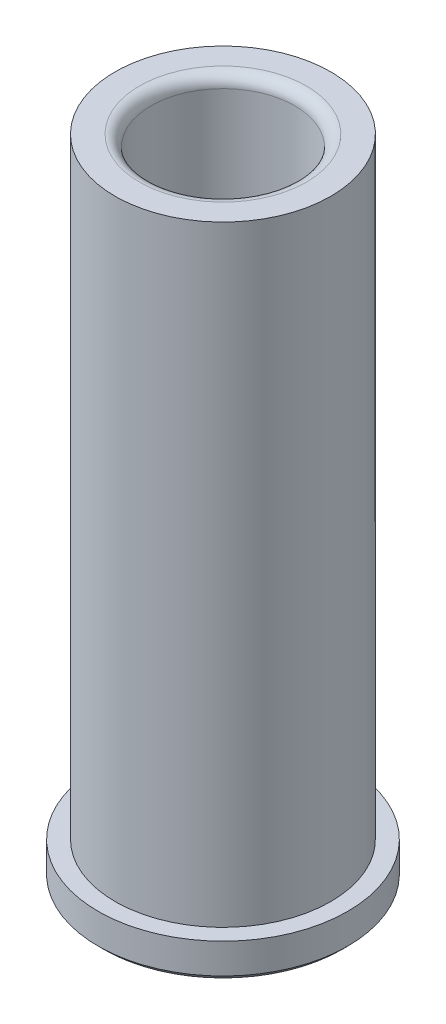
ISO-10303-21;
HEADER;
FILE_DESCRIPTION(('STEP AP214'),'2;1');
FILE_NAME('part.step','',(''),(''),'','','');
FILE_SCHEMA(('AUTOMOTIVE_DESIGN { 1 0 10303 214 1 1 1 1 }'));
ENDSEC;
DATA;
#1=APPLICATION_CONTEXT('core data for automotive mechanical design processes');
#2=APPLICATION_PROTOCOL_DEFINITION('international standard','automotive_design',2000,#1);
#3=PRODUCT_CONTEXT('',#1,'mechanical');
#4=PRODUCT('Part','Part','',(#3));
#5=PRODUCT_RELATED_PRODUCT_CATEGORY('part','',(#4));
#6=PRODUCT_DEFINITION_FORMATION('','',#4);
#7=PRODUCT_DEFINITION_CONTEXT('part definition',#1,'design');
#8=PRODUCT_DEFINITION('design','',#6,#7);
#9=PRODUCT_DEFINITION_SHAPE('','',#8);
#10=(LENGTH_UNIT() NAMED_UNIT(*) SI_UNIT(.MILLI.,.METRE.));
#11=(NAMED_UNIT(*) PLANE_ANGLE_UNIT() SI_UNIT($,.RADIAN.));
#12=(NAMED_UNIT(*) SI_UNIT($,.STERADIAN.) SOLID_ANGLE_UNIT());
#13=UNCERTAINTY_MEASURE_WITH_UNIT(LENGTH_MEASURE(1.E-05),#10,'distance_accuracy_value','');
#14=(GEOMETRIC_REPRESENTATION_CONTEXT(3) GLOBAL_UNCERTAINTY_ASSIGNED_CONTEXT((#13)) GLOBAL_UNIT_ASSIGNED_CONTEXT((#10,
#11,#12)) REPRESENTATION_CONTEXT('',''));
#15=CARTESIAN_POINT('',(0.,0.,0.));
#16=DIRECTION('',(0.,0.,1.));
#17=DIRECTION('',(1.,0.,0.));
#18=AXIS2_PLACEMENT_3D('',#15,#16,#17);
#19=CARTESIAN_POINT('',(3.49148336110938E-12,-1000.,0.));
#20=DIRECTION('',(0.,-1.,0.));
#21=DIRECTION('',(1.,0.,0.));
#22=AXIS2_PLACEMENT_3D('',#19,#20,#21);
#23=CYLINDRICAL_SURFACE('',#22,14.2938499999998);
#24=CARTESIAN_POINT('',(0.,4.7625,0.));
#25=DIRECTION('',(0.,-1.,0.));
#26=DIRECTION('',(1.,0.,0.));
#27=AXIS2_PLACEMENT_3D('',#24,#25,#26);
#28=CIRCLE('',#27,14.29385);
#29=CARTESIAN_POINT('',(14.29385,4.76250000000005,0.));
#30=VERTEX_POINT('',#29);
#31=EDGE_CURVE('E60',#30,#30,#28,.T.);
#32=ORIENTED_EDGE('',*,*,#31,.F.);
#33=EDGE_LOOP('',(#32));
#34=FACE_BOUND('',#33,.T.);
#35=CARTESIAN_POINT('',(-2.99307411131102E-13,85.7250000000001,0.));
#36=DIRECTION('',(0.,-1.,0.));
#37=DIRECTION('',(1.,0.,0.));
#38=AXIS2_PLACEMENT_3D('',#35,#36,#37);
#39=CIRCLE('',#38,14.2938499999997);
#40=CARTESIAN_POINT('',(14.2938499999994,85.7250000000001,0.));
#41=VERTEX_POINT('',#40);
#42=EDGE_CURVE('E39',#41,#41,#39,.T.);
#43=ORIENTED_EDGE('',*,*,#42,.T.);
#44=EDGE_LOOP('',(#43));
#45=FACE_BOUND('',#44,.T.);
#46=ADVANCED_FACE('F28',(#34,#45),#23,.T.);
#47=CARTESIAN_POINT('',(-14.29385,85.725,0.));
#48=DIRECTION('',(0.,-1.,0.));
#49=DIRECTION('',(1.,0.,0.));
#50=AXIS2_PLACEMENT_3D('',#47,#48,#49);
#51=PLANE('',#50);
#52=CARTESIAN_POINT('',(-2.99307411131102E-13,85.725,0.));
#53=DIRECTION('',(0.,-1.,0.));
#54=DIRECTION('',(1.,0.,0.));
#55=AXIS2_PLACEMENT_3D('',#52,#53,#54);
#56=CIRCLE('',#55,11.0553499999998);
#57=CARTESIAN_POINT('',(11.0553499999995,85.7250000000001,0.));
#58=VERTEX_POINT('',#57);
#59=EDGE_CURVE('E35',#58,#58,#56,.T.);
#60=ORIENTED_EDGE('',*,*,#59,.T.);
#61=EDGE_LOOP('',(#60));
#62=FACE_BOUND('',#61,.T.);
#63=ORIENTED_EDGE('',*,*,#42,.F.);
#64=EDGE_LOOP('',(#63));
#65=FACE_BOUND('',#64,.T.);
#66=ADVANCED_FACE('F68',(#62,#65),#51,.F.);
#67=CARTESIAN_POINT('',(3.49148336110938E-12,-1000.,0.));
#68=DIRECTION('',(0.,-1.,0.));
#69=DIRECTION('',(1.,0.,0.));
#70=AXIS2_PLACEMENT_3D('',#67,#68,#69);
#71=CYLINDRICAL_SURFACE('',#70,9.53134999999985);
#72=CARTESIAN_POINT('',(-2.93986390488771E-13,84.201,0.));
#73=DIRECTION('',(0.,-1.,0.));
#74=DIRECTION('',(1.,0.,0.));
#75=AXIS2_PLACEMENT_3D('',#72,#73,#74);
#76=CIRCLE('',#75,9.53134999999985);
#77=CARTESIAN_POINT('',(9.53134999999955,84.201,0.));
#78=VERTEX_POINT('',#77);
#79=EDGE_CURVE('E10',#78,#78,#76,.F.);
#80=ORIENTED_EDGE('',*,*,#79,.T.);
#81=EDGE_LOOP('',(#80));
#82=FACE_BOUND('',#81,.T.);
#83=CARTESIAN_POINT('',(0.,0.761999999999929,0.));
#84=DIRECTION('',(0.,-1.,0.));
#85=DIRECTION('',(1.,0.,0.));
#86=AXIS2_PLACEMENT_3D('',#83,#84,#85);
#87=CIRCLE('',#86,9.53134999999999);
#88=CARTESIAN_POINT('',(9.53134999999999,0.761999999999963,0.));
#89=VERTEX_POINT('',#88);
#90=EDGE_CURVE('E43',#89,#89,#87,.T.);
#91=ORIENTED_EDGE('',*,*,#90,.T.);
#92=EDGE_LOOP('',(#91));
#93=FACE_BOUND('',#92,.T.);
#94=ADVANCED_FACE('F72',(#82,#93),#71,.F.);
#95=CARTESIAN_POINT('',(0.,0.,0.));
#96=DIRECTION('',(0.,-1.,0.));
#97=DIRECTION('',(1.,0.,0.));
#98=AXIS2_PLACEMENT_3D('',#95,#96,#97);
#99=CONICAL_SURFACE('',#98,10.29335,0.785398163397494);
#100=ORIENTED_EDGE('',*,*,#90,.F.);
#101=EDGE_LOOP('',(#100));
#102=FACE_BOUND('',#101,.T.);
#103=CARTESIAN_POINT('',(0.,0.,0.));
#104=DIRECTION('',(0.,-1.,0.));
#105=DIRECTION('',(1.,0.,0.));
#106=AXIS2_PLACEMENT_3D('',#103,#104,#105);
#107=CIRCLE('',#106,10.29335);
#108=CARTESIAN_POINT('',(10.29335,0.,0.));
#109=VERTEX_POINT('',#108);
#110=EDGE_CURVE('E48',#109,#109,#107,.T.);
#111=ORIENTED_EDGE('',*,*,#110,.T.);
#112=EDGE_LOOP('',(#111));
#113=FACE_BOUND('',#112,.T.);
#114=ADVANCED_FACE('F77',(#102,#113),#99,.F.);
#115=CARTESIAN_POINT('',(-10.29335,0.,0.));
#116=DIRECTION('',(0.,1.,0.));
#117=DIRECTION('',(-1.,0.,0.));
#118=AXIS2_PLACEMENT_3D('',#115,#116,#117);
#119=PLANE('',#118);
#120=ORIENTED_EDGE('',*,*,#110,.F.);
#121=EDGE_LOOP('',(#120));
#122=FACE_BOUND('',#121,.T.);
#123=CARTESIAN_POINT('',(0.,0.,0.));
#124=DIRECTION('',(0.,-1.,0.));
#125=DIRECTION('',(1.,0.,0.));
#126=AXIS2_PLACEMENT_3D('',#123,#124,#125);
#127=CIRCLE('',#126,15.7734);
#128=CARTESIAN_POINT('',(15.7734,0.,0.));
#129=VERTEX_POINT('',#128);
#130=EDGE_CURVE('E51',#129,#129,#127,.T.);
#131=ORIENTED_EDGE('',*,*,#130,.T.);
#132=EDGE_LOOP('',(#131));
#133=FACE_BOUND('',#132,.T.);
#134=ADVANCED_FACE('F82',(#122,#133),#119,.F.);
#135=CARTESIAN_POINT('',(0.,0.761999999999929,0.));
#136=DIRECTION('',(0.,1.,0.));
#137=DIRECTION('',(-1.,0.,0.));
#138=AXIS2_PLACEMENT_3D('',#135,#136,#137);
#139=CONICAL_SURFACE('',#138,16.5354,0.785398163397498);
#140=ORIENTED_EDGE('',*,*,#130,.F.);
#141=EDGE_LOOP('',(#140));
#142=FACE_BOUND('',#141,.T.);
#143=CARTESIAN_POINT('',(0.,0.761999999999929,0.));
#144=DIRECTION('',(0.,-1.,0.));
#145=DIRECTION('',(1.,0.,0.));
#146=AXIS2_PLACEMENT_3D('',#143,#144,#145);
#147=CIRCLE('',#146,16.5354);
#148=CARTESIAN_POINT('',(16.5354,0.761999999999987,0.));
#149=VERTEX_POINT('',#148);
#150=EDGE_CURVE('E54',#149,#149,#147,.T.);
#151=ORIENTED_EDGE('',*,*,#150,.T.);
#152=EDGE_LOOP('',(#151));
#153=FACE_BOUND('',#152,.T.);
#154=ADVANCED_FACE('F86',(#142,#153),#139,.T.);
#155=CARTESIAN_POINT('',(3.49148336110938E-12,-1000.,0.));
#156=DIRECTION('',(0.,-1.,0.));
#157=DIRECTION('',(1.,0.,0.));
#158=AXIS2_PLACEMENT_3D('',#155,#156,#157);
#159=CYLINDRICAL_SURFACE('',#158,16.5354);
#160=ORIENTED_EDGE('',*,*,#150,.F.);
#161=EDGE_LOOP('',(#160));
#162=FACE_BOUND('',#161,.T.);
#163=CARTESIAN_POINT('',(0.,4.7625,0.));
#164=DIRECTION('',(0.,-1.,0.));
#165=DIRECTION('',(1.,0.,0.));
#166=AXIS2_PLACEMENT_3D('',#163,#164,#165);
#167=CIRCLE('',#166,16.5354);
#168=CARTESIAN_POINT('',(16.5354,4.76250000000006,0.));
#169=VERTEX_POINT('',#168);
#170=EDGE_CURVE('E57',#169,#169,#167,.T.);
#171=ORIENTED_EDGE('',*,*,#170,.T.);
#172=EDGE_LOOP('',(#171));
#173=FACE_BOUND('',#172,.T.);
#174=ADVANCED_FACE('F90',(#162,#173),#159,.T.);
#175=CARTESIAN_POINT('',(-16.5354,4.76249999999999,0.));
#176=DIRECTION('',(0.,-1.,0.));
#177=DIRECTION('',(1.,0.,0.));
#178=AXIS2_PLACEMENT_3D('',#175,#176,#177);
#179=PLANE('',#178);
#180=ORIENTED_EDGE('',*,*,#170,.F.);
#181=EDGE_LOOP('',(#180));
#182=FACE_BOUND('',#181,.T.);
#183=ORIENTED_EDGE('',*,*,#31,.T.);
#184=EDGE_LOOP('',(#183));
#185=FACE_BOUND('',#184,.T.);
#186=ADVANCED_FACE('F64',(#182,#185),#179,.F.);
#187=CARTESIAN_POINT('',(-2.93986390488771E-13,84.201,0.));
#188=DIRECTION('',(0.,-1.,0.));
#189=DIRECTION('',(1.,0.,0.));
#190=AXIS2_PLACEMENT_3D('',#187,#188,#189);
#191=TOROIDAL_SURFACE('',#190,11.0553499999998,1.524);
#192=ORIENTED_EDGE('',*,*,#79,.F.);
#193=EDGE_LOOP('',(#192));
#194=FACE_BOUND('',#193,.T.);
#195=ORIENTED_EDGE('',*,*,#59,.F.);
#196=EDGE_LOOP('',(#195));
#197=FACE_BOUND('',#196,.T.);
#198=ADVANCED_FACE('F30',(#194,#197),#191,.T.);
#199=CLOSED_SHELL('',(#46,#66,#94,#114,#134,#154,#174,#186,#198));
#200=MANIFOLD_SOLID_BREP('B2',#199);
#201=ADVANCED_BREP_SHAPE_REPRESENTATION('',(#18,#200),#14);
#202=SHAPE_DEFINITION_REPRESENTATION(#9,#201);
ENDSEC;
END-ISO-10303-21;
